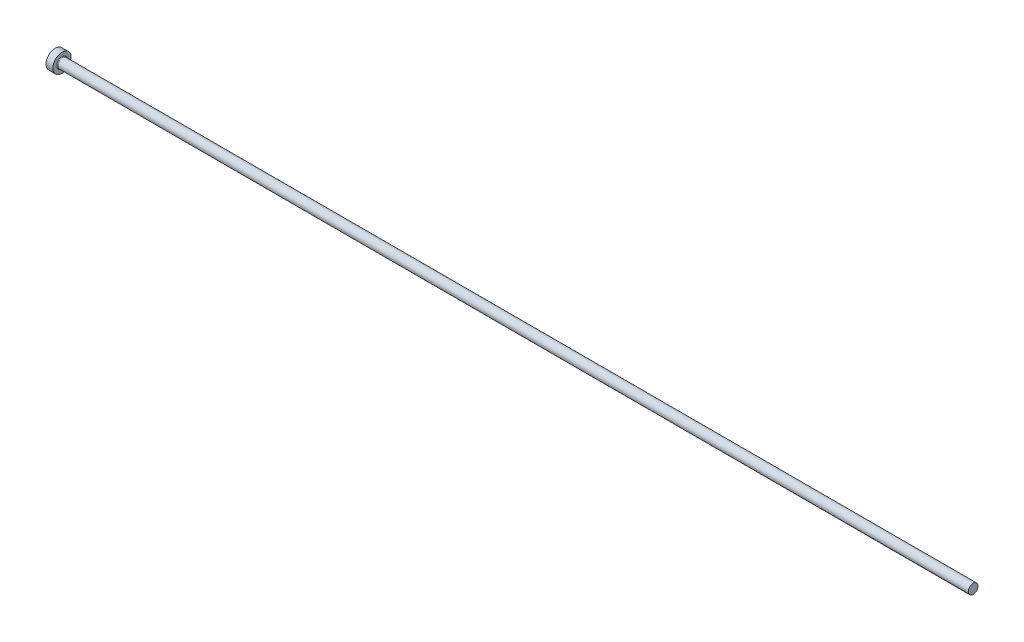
ISO-10303-21;
HEADER;
FILE_DESCRIPTION(('STEP AP214'),'2;1');
FILE_NAME('part.step','',(''),(''),'','','');
FILE_SCHEMA(('AUTOMOTIVE_DESIGN { 1 0 10303 214 1 1 1 1 }'));
ENDSEC;
DATA;
#1=APPLICATION_CONTEXT('core data for automotive mechanical design processes');
#2=APPLICATION_PROTOCOL_DEFINITION('international standard','automotive_design',2000,#1);
#3=PRODUCT_CONTEXT('',#1,'mechanical');
#4=PRODUCT('Part','Part','',(#3));
#5=PRODUCT_RELATED_PRODUCT_CATEGORY('part','',(#4));
#6=PRODUCT_DEFINITION_FORMATION('','',#4);
#7=PRODUCT_DEFINITION_CONTEXT('part definition',#1,'design');
#8=PRODUCT_DEFINITION('design','',#6,#7);
#9=PRODUCT_DEFINITION_SHAPE('','',#8);
#10=(LENGTH_UNIT() NAMED_UNIT(*) SI_UNIT(.MILLI.,.METRE.));
#11=(NAMED_UNIT(*) PLANE_ANGLE_UNIT() SI_UNIT($,.RADIAN.));
#12=(NAMED_UNIT(*) SI_UNIT($,.STERADIAN.) SOLID_ANGLE_UNIT());
#13=UNCERTAINTY_MEASURE_WITH_UNIT(LENGTH_MEASURE(1.E-05),#10,'distance_accuracy_value','');
#14=(GEOMETRIC_REPRESENTATION_CONTEXT(3) GLOBAL_UNCERTAINTY_ASSIGNED_CONTEXT((#13)) GLOBAL_UNIT_ASSIGNED_CONTEXT((#10,
#11,#12)) REPRESENTATION_CONTEXT('',''));
#15=CARTESIAN_POINT('',(0.,0.,0.));
#16=DIRECTION('',(0.,0.,1.));
#17=DIRECTION('',(1.,0.,0.));
#18=AXIS2_PLACEMENT_3D('',#15,#16,#17);
#19=CARTESIAN_POINT('',(0.,0.,0.));
#20=DIRECTION('',(-1.,0.,0.));
#21=DIRECTION('',(0.,-1.,0.));
#22=AXIS2_PLACEMENT_3D('',#19,#20,#21);
#23=PLANE('',#22);
#24=CARTESIAN_POINT('',(0.,0.,0.));
#25=DIRECTION('',(1.,0.,0.));
#26=DIRECTION('',(0.,1.,0.));
#27=AXIS2_PLACEMENT_3D('',#24,#25,#26);
#28=CIRCLE('',#27,4.);
#29=CARTESIAN_POINT('',(0.,4.,0.));
#30=VERTEX_POINT('',#29);
#31=EDGE_CURVE('E24',#30,#30,#28,.T.);
#32=ORIENTED_EDGE('',*,*,#31,.F.);
#33=EDGE_LOOP('',(#32));
#34=FACE_BOUND('',#33,.T.);
#35=ADVANCED_FACE('F13',(#34),#23,.T.);
#36=CARTESIAN_POINT('',(400.,0.,0.));
#37=DIRECTION('',(1.,0.,0.));
#38=DIRECTION('',(0.,1.,0.));
#39=AXIS2_PLACEMENT_3D('',#36,#37,#38);
#40=CYLINDRICAL_SURFACE('',#39,4.);
#41=ORIENTED_EDGE('',*,*,#31,.T.);
#42=EDGE_LOOP('',(#41));
#43=FACE_BOUND('',#42,.T.);
#44=CARTESIAN_POINT('',(3.,0.,0.));
#45=DIRECTION('',(1.,0.,0.));
#46=DIRECTION('',(0.,1.,0.));
#47=AXIS2_PLACEMENT_3D('',#44,#45,#46);
#48=CIRCLE('',#47,4.);
#49=CARTESIAN_POINT('',(3.,4.,0.));
#50=VERTEX_POINT('',#49);
#51=EDGE_CURVE('E28',#50,#50,#48,.T.);
#52=ORIENTED_EDGE('',*,*,#51,.F.);
#53=EDGE_LOOP('',(#52));
#54=FACE_BOUND('',#53,.T.);
#55=ADVANCED_FACE('F50',(#43,#54),#40,.T.);
#56=CARTESIAN_POINT('',(3.,4.,0.));
#57=DIRECTION('',(1.,0.,0.));
#58=DIRECTION('',(0.,1.,0.));
#59=AXIS2_PLACEMENT_3D('',#56,#57,#58);
#60=PLANE('',#59);
#61=CARTESIAN_POINT('',(3.,0.,0.));
#62=DIRECTION('',(1.,0.,0.));
#63=DIRECTION('',(0.,1.,0.));
#64=AXIS2_PLACEMENT_3D('',#61,#62,#63);
#65=CIRCLE('',#64,2.39999999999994);
#66=CARTESIAN_POINT('',(3.,2.39999999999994,0.));
#67=VERTEX_POINT('',#66);
#68=EDGE_CURVE('E8',#67,#67,#65,.F.);
#69=ORIENTED_EDGE('',*,*,#68,.T.);
#70=EDGE_LOOP('',(#69));
#71=FACE_BOUND('',#70,.T.);
#72=ORIENTED_EDGE('',*,*,#51,.T.);
#73=EDGE_LOOP('',(#72));
#74=FACE_BOUND('',#73,.T.);
#75=ADVANCED_FACE('F41',(#71,#74),#60,.T.);
#76=CARTESIAN_POINT('',(400.,0.,0.));
#77=DIRECTION('',(1.,0.,0.));
#78=DIRECTION('',(0.,1.,0.));
#79=AXIS2_PLACEMENT_3D('',#76,#77,#78);
#80=CYLINDRICAL_SURFACE('',#79,2.09999999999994);
#81=CARTESIAN_POINT('',(3.3,0.,0.));
#82=DIRECTION('',(1.,0.,0.));
#83=DIRECTION('',(0.,1.,0.));
#84=AXIS2_PLACEMENT_3D('',#81,#82,#83);
#85=CIRCLE('',#84,2.09999999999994);
#86=CARTESIAN_POINT('',(3.3,2.09999999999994,0.));
#87=VERTEX_POINT('',#86);
#88=EDGE_CURVE('E20',#87,#87,#85,.T.);
#89=ORIENTED_EDGE('',*,*,#88,.T.);
#90=EDGE_LOOP('',(#89));
#91=FACE_BOUND('',#90,.T.);
#92=CARTESIAN_POINT('',(400.,0.,0.));
#93=DIRECTION('',(1.,0.,0.));
#94=DIRECTION('',(0.,1.,0.));
#95=AXIS2_PLACEMENT_3D('',#92,#93,#94);
#96=CIRCLE('',#95,2.09999999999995);
#97=CARTESIAN_POINT('',(400.,2.09999999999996,0.));
#98=VERTEX_POINT('',#97);
#99=EDGE_CURVE('E33',#98,#98,#96,.T.);
#100=ORIENTED_EDGE('',*,*,#99,.F.);
#101=EDGE_LOOP('',(#100));
#102=FACE_BOUND('',#101,.T.);
#103=ADVANCED_FACE('F39',(#91,#102),#80,.T.);
#104=CARTESIAN_POINT('',(400.,2.09999999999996,0.));
#105=DIRECTION('',(1.,0.,0.));
#106=DIRECTION('',(0.,1.,0.));
#107=AXIS2_PLACEMENT_3D('',#104,#105,#106);
#108=PLANE('',#107);
#109=ORIENTED_EDGE('',*,*,#99,.T.);
#110=EDGE_LOOP('',(#109));
#111=FACE_BOUND('',#110,.T.);
#112=ADVANCED_FACE('F37',(#111),#108,.T.);
#113=CARTESIAN_POINT('',(3.3,0.,0.));
#114=DIRECTION('',(1.,0.,0.));
#115=DIRECTION('',(0.,1.,0.));
#116=AXIS2_PLACEMENT_3D('',#113,#114,#115);
#117=TOROIDAL_SURFACE('',#116,2.39999999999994,0.3);
#118=ORIENTED_EDGE('',*,*,#68,.F.);
#119=EDGE_LOOP('',(#118));
#120=FACE_BOUND('',#119,.T.);
#121=ORIENTED_EDGE('',*,*,#88,.F.);
#122=EDGE_LOOP('',(#121));
#123=FACE_BOUND('',#122,.T.);
#124=ADVANCED_FACE('F15',(#120,#123),#117,.F.);
#125=CLOSED_SHELL('',(#35,#55,#75,#103,#112,#124));
#126=MANIFOLD_SOLID_BREP('B1',#125);
#127=ADVANCED_BREP_SHAPE_REPRESENTATION('',(#18,#126),#14);
#128=SHAPE_DEFINITION_REPRESENTATION(#9,#127);
ENDSEC;
END-ISO-10303-21;
